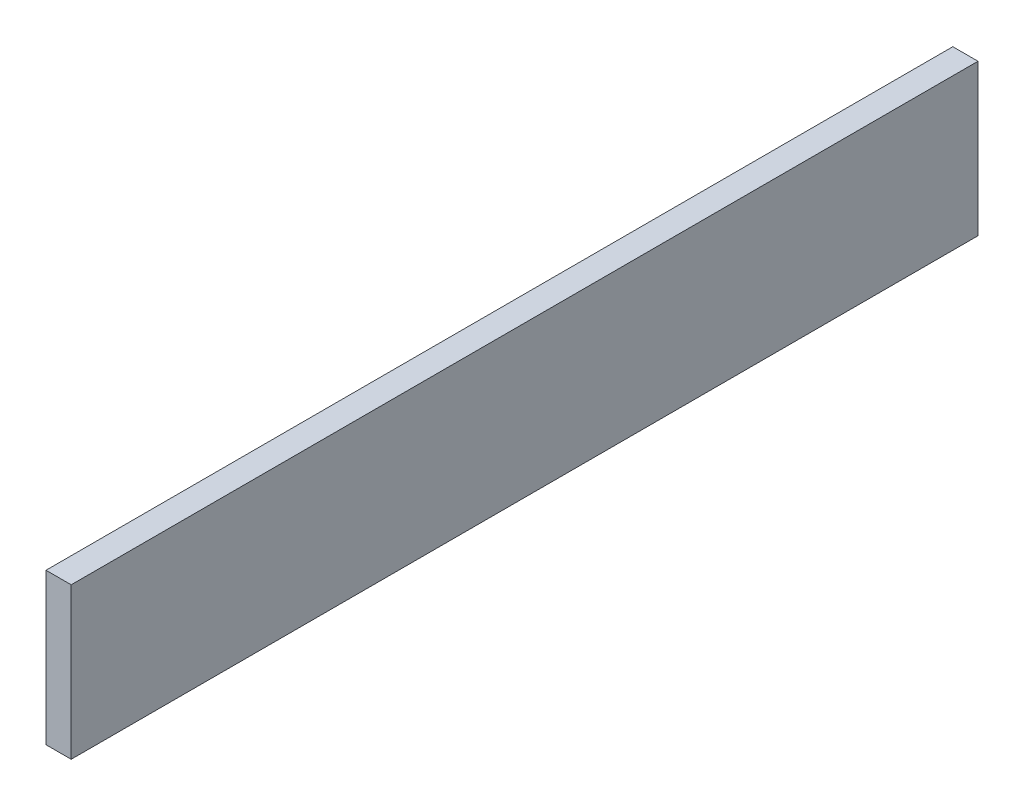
ISO-10303-21;
HEADER;
FILE_DESCRIPTION(('STEP AP214'),'2;1');
FILE_NAME('part.step','',(''),(''),'','','');
FILE_SCHEMA(('AUTOMOTIVE_DESIGN { 1 0 10303 214 1 1 1 1 }'));
ENDSEC;
DATA;
#1=APPLICATION_CONTEXT('core data for automotive mechanical design processes');
#2=APPLICATION_PROTOCOL_DEFINITION('international standard','automotive_design',2000,#1);
#3=PRODUCT_CONTEXT('',#1,'mechanical');
#4=PRODUCT('Part','Part','',(#3));
#5=PRODUCT_RELATED_PRODUCT_CATEGORY('part','',(#4));
#6=PRODUCT_DEFINITION_FORMATION('','',#4);
#7=PRODUCT_DEFINITION_CONTEXT('part definition',#1,'design');
#8=PRODUCT_DEFINITION('design','',#6,#7);
#9=PRODUCT_DEFINITION_SHAPE('','',#8);
#10=(LENGTH_UNIT() NAMED_UNIT(*) SI_UNIT(.MILLI.,.METRE.));
#11=(NAMED_UNIT(*) PLANE_ANGLE_UNIT() SI_UNIT($,.RADIAN.));
#12=(NAMED_UNIT(*) SI_UNIT($,.STERADIAN.) SOLID_ANGLE_UNIT());
#13=UNCERTAINTY_MEASURE_WITH_UNIT(LENGTH_MEASURE(1.E-05),#10,'distance_accuracy_value','');
#14=(GEOMETRIC_REPRESENTATION_CONTEXT(3) GLOBAL_UNCERTAINTY_ASSIGNED_CONTEXT((#13)) GLOBAL_UNIT_ASSIGNED_CONTEXT((#10,
#11,#12)) REPRESENTATION_CONTEXT('',''));
#15=CARTESIAN_POINT('',(0.,0.,0.));
#16=DIRECTION('',(0.,0.,1.));
#17=DIRECTION('',(1.,0.,0.));
#18=AXIS2_PLACEMENT_3D('',#15,#16,#17);
#19=CARTESIAN_POINT('',(3.175,0.,57.15));
#20=DIRECTION('',(-1.,0.,0.));
#21=DIRECTION('',(0.,-1.,0.));
#22=AXIS2_PLACEMENT_3D('',#19,#20,#21);
#23=PLANE('',#22);
#24=DIRECTION('',(0.,1.,0.));
#25=VECTOR('',#24,1.);
#26=CARTESIAN_POINT('',(3.175,0.,-57.15));
#27=LINE('',#26,#25);
#28=CARTESIAN_POINT('',(3.175,-19.05,-57.15));
#29=VERTEX_POINT('',#28);
#30=CARTESIAN_POINT('',(3.175,0.,-57.15));
#31=VERTEX_POINT('',#30);
#32=EDGE_CURVE('E98',#29,#31,#27,.T.);
#33=ORIENTED_EDGE('',*,*,#32,.T.);
#34=DIRECTION('',(0.,0.,-1.));
#35=VECTOR('',#34,1.);
#36=CARTESIAN_POINT('',(3.175,0.,57.15));
#37=LINE('',#36,#35);
#38=CARTESIAN_POINT('',(3.175,0.,57.15));
#39=VERTEX_POINT('',#38);
#40=EDGE_CURVE('E11',#39,#31,#37,.T.);
#41=ORIENTED_EDGE('',*,*,#40,.F.);
#42=DIRECTION('',(0.,1.,0.));
#43=VECTOR('',#42,1.);
#44=CARTESIAN_POINT('',(3.175,0.,57.15));
#45=LINE('',#44,#43);
#46=CARTESIAN_POINT('',(3.175,-19.05,57.15));
#47=VERTEX_POINT('',#46);
#48=EDGE_CURVE('E86',#47,#39,#45,.T.);
#49=ORIENTED_EDGE('',*,*,#48,.F.);
#50=DIRECTION('',(0.,0.,-1.));
#51=VECTOR('',#50,1.);
#52=CARTESIAN_POINT('',(3.175,-19.05,57.15));
#53=LINE('',#52,#51);
#54=EDGE_CURVE('E94',#47,#29,#53,.T.);
#55=ORIENTED_EDGE('',*,*,#54,.T.);
#56=EDGE_LOOP('',(#33,#41,#49,#55));
#57=FACE_BOUND('',#56,.T.);
#58=ADVANCED_FACE('F35',(#57),#23,.F.);
#59=CARTESIAN_POINT('',(0.,0.,57.15));
#60=DIRECTION('',(0.,-1.,0.));
#61=DIRECTION('',(0.,0.,-1.));
#62=AXIS2_PLACEMENT_3D('',#59,#60,#61);
#63=PLANE('',#62);
#64=DIRECTION('',(-1.,0.,0.));
#65=VECTOR('',#64,1.);
#66=CARTESIAN_POINT('',(0.,0.,-57.15));
#67=LINE('',#66,#65);
#68=CARTESIAN_POINT('',(0.,0.,-57.15));
#69=VERTEX_POINT('',#68);
#70=EDGE_CURVE('E90',#31,#69,#67,.T.);
#71=ORIENTED_EDGE('',*,*,#70,.T.);
#72=DIRECTION('',(0.,0.,-1.));
#73=VECTOR('',#72,1.);
#74=CARTESIAN_POINT('',(0.,0.,57.15));
#75=LINE('',#74,#73);
#76=CARTESIAN_POINT('',(0.,0.,57.15));
#77=VERTEX_POINT('',#76);
#78=EDGE_CURVE('E43',#77,#69,#75,.T.);
#79=ORIENTED_EDGE('',*,*,#78,.F.);
#80=DIRECTION('',(-1.,0.,0.));
#81=VECTOR('',#80,1.);
#82=CARTESIAN_POINT('',(0.,0.,57.15));
#83=LINE('',#82,#81);
#84=EDGE_CURVE('E81',#39,#77,#83,.T.);
#85=ORIENTED_EDGE('',*,*,#84,.F.);
#86=ORIENTED_EDGE('',*,*,#40,.T.);
#87=EDGE_LOOP('',(#71,#79,#85,#86));
#88=FACE_BOUND('',#87,.T.);
#89=ADVANCED_FACE('F89',(#88),#63,.F.);
#90=CARTESIAN_POINT('',(0.,0.,57.15));
#91=DIRECTION('',(1.,0.,0.));
#92=DIRECTION('',(0.,1.,0.));
#93=AXIS2_PLACEMENT_3D('',#90,#91,#92);
#94=PLANE('',#93);
#95=DIRECTION('',(0.,-1.,0.));
#96=VECTOR('',#95,1.);
#97=CARTESIAN_POINT('',(0.,0.,-57.15));
#98=LINE('',#97,#96);
#99=CARTESIAN_POINT('',(0.,-19.05,-57.15));
#100=VERTEX_POINT('',#99);
#101=EDGE_CURVE('E68',#69,#100,#98,.T.);
#102=ORIENTED_EDGE('',*,*,#101,.T.);
#103=DIRECTION('',(0.,0.,-1.));
#104=VECTOR('',#103,1.);
#105=CARTESIAN_POINT('',(0.,-19.05,57.15));
#106=LINE('',#105,#104);
#107=CARTESIAN_POINT('',(0.,-19.05,57.15));
#108=VERTEX_POINT('',#107);
#109=EDGE_CURVE('E91',#108,#100,#106,.T.);
#110=ORIENTED_EDGE('',*,*,#109,.F.);
#111=DIRECTION('',(0.,-1.,0.));
#112=VECTOR('',#111,1.);
#113=CARTESIAN_POINT('',(0.,0.,57.15));
#114=LINE('',#113,#112);
#115=EDGE_CURVE('E84',#77,#108,#114,.T.);
#116=ORIENTED_EDGE('',*,*,#115,.F.);
#117=ORIENTED_EDGE('',*,*,#78,.T.);
#118=EDGE_LOOP('',(#102,#110,#116,#117));
#119=FACE_BOUND('',#118,.T.);
#120=ADVANCED_FACE('F92',(#119),#94,.F.);
#121=CARTESIAN_POINT('',(3.175,-19.05,57.15));
#122=DIRECTION('',(0.,1.,0.));
#123=DIRECTION('',(0.,0.,1.));
#124=AXIS2_PLACEMENT_3D('',#121,#122,#123);
#125=PLANE('',#124);
#126=DIRECTION('',(1.,0.,0.));
#127=VECTOR('',#126,1.);
#128=CARTESIAN_POINT('',(3.175,-19.05,-57.15));
#129=LINE('',#128,#127);
#130=EDGE_CURVE('E74',#100,#29,#129,.T.);
#131=ORIENTED_EDGE('',*,*,#130,.T.);
#132=ORIENTED_EDGE('',*,*,#54,.F.);
#133=DIRECTION('',(1.,0.,0.));
#134=VECTOR('',#133,1.);
#135=CARTESIAN_POINT('',(3.175,-19.05,57.15));
#136=LINE('',#135,#134);
#137=EDGE_CURVE('E51',#108,#47,#136,.T.);
#138=ORIENTED_EDGE('',*,*,#137,.F.);
#139=ORIENTED_EDGE('',*,*,#109,.T.);
#140=EDGE_LOOP('',(#131,#132,#138,#139));
#141=FACE_BOUND('',#140,.T.);
#142=ADVANCED_FACE('F105',(#141),#125,.F.);
#143=CARTESIAN_POINT('',(0.,0.,57.15));
#144=DIRECTION('',(0.,0.,-1.));
#145=DIRECTION('',(-1.,0.,0.));
#146=AXIS2_PLACEMENT_3D('',#143,#144,#145);
#147=PLANE('',#146);
#148=ORIENTED_EDGE('',*,*,#48,.T.);
#149=ORIENTED_EDGE('',*,*,#84,.T.);
#150=ORIENTED_EDGE('',*,*,#115,.T.);
#151=ORIENTED_EDGE('',*,*,#137,.T.);
#152=EDGE_LOOP('',(#148,#149,#150,#151));
#153=FACE_BOUND('',#152,.T.);
#154=ADVANCED_FACE('F82',(#153),#147,.F.);
#155=CARTESIAN_POINT('',(0.,0.,-57.15));
#156=DIRECTION('',(0.,0.,-1.));
#157=DIRECTION('',(-1.,0.,0.));
#158=AXIS2_PLACEMENT_3D('',#155,#156,#157);
#159=PLANE('',#158);
#160=ORIENTED_EDGE('',*,*,#32,.F.);
#161=ORIENTED_EDGE('',*,*,#130,.F.);
#162=ORIENTED_EDGE('',*,*,#101,.F.);
#163=ORIENTED_EDGE('',*,*,#70,.F.);
#164=EDGE_LOOP('',(#160,#161,#162,#163));
#165=FACE_BOUND('',#164,.T.);
#166=ADVANCED_FACE('F108',(#165),#159,.T.);
#167=CLOSED_SHELL('',(#58,#89,#120,#142,#154,#166));
#168=MANIFOLD_SOLID_BREP('B2',#167);
#169=ADVANCED_BREP_SHAPE_REPRESENTATION('',(#18,#168),#14);
#170=SHAPE_DEFINITION_REPRESENTATION(#9,#169);
ENDSEC;
END-ISO-10303-21;
